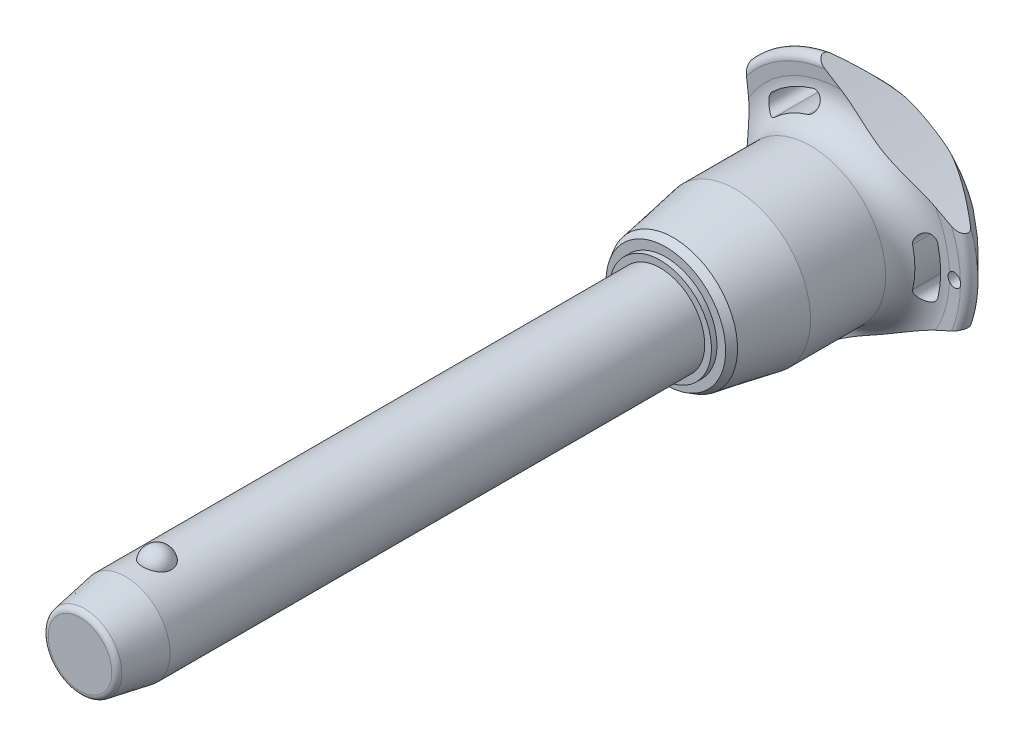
from build123d import *

# Parameters (mm, degrees)
SKETCH1_R           = 10
BOSS_EXTRUDE1_DEPTH = 110
SKETCH2_R           = 8.75
BOSS_EXTRUDE2_DEPTH = 50.7
BOSS_EXTRUDE3_START = 20.5
SKETCH1_2_R         = 10
BOSS_EXTRUDE3_DEPTH = 20.5
CHAMFER1_SIZE       = 10.25
CHAMFER1_SIZE2      = 1.807351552
FILLET1_R           = 1.25
SKETCH6_R           = 176.92625
CUT_EXTRUDE1_DEPTH  = 166.695054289
CIRPATTERN1_COUNT   = 3
SKETCH7_R           = 1.5
CUT_EXTRUDE2_DEPTH  = 166.603156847


with BuildPart() as part:
    # Sketch1 → Boss-Extrude1 (new body)
    with BuildSketch(Plane.XY):
        Circle(SKETCH1_R)
    extrude(amount=-BOSS_EXTRUDE1_DEPTH)

    # Sketch2 → Boss-Extrude2 (add)
    with BuildSketch(Plane(origin=(0, 0, -110), x_dir=(-1, 0, 0), z_dir=(0, 0, -1))):
        with Locations(Location((0, 0, 0), (0, 0, 180))):
            Circle(SKETCH2_R)
    extrude(amount=BOSS_EXTRUDE2_DEPTH)

    # Sketch3 → Revolve1 (revolve)
    with BuildSketch(Plane(origin=(0, 0, 0), x_dir=(0, 0, -1), z_dir=(1, 0, 0))):
        with BuildLine():
            Line((-3.201562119, 12.5), (-3.201562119, 5.9))
            ThreePointArc((-3.201562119, 5.9), (0.098437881, 9.2), (-3.201562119, 12.5))
        make_face()
        with BuildLine():
            Line((-3.201562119, -5.9), (-3.201562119, -12.5))
            ThreePointArc((-3.201562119, -12.5), (0.098437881, -9.2), (-3.201562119, -5.9))
        make_face()
    revolve(axis=Axis((0, -5.9, 3.201562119), (0, 1, 0)))

    # Sketch1_2 → Boss-Extrude3 (add)
    with BuildSketch(Plane.XY.offset(BOSS_EXTRUDE3_START)):
        Circle(SKETCH1_2_R)
    extrude(amount=-BOSS_EXTRUDE3_DEPTH)

    # Chamfer1
    chamfer1_edges = [part.edges().sort_by_distance(p)[0] for p in [
        (-10, 0, 20.5),
    ]]
    chamfer1_side = [part.faces().sort_by_distance(p)[0] for p in [
        (-10, 0, -44.75),
    ]]
    chamfer(chamfer1_edges, length=CHAMFER1_SIZE, length2=CHAMFER1_SIZE2, reference=chamfer1_side[0])

    # Fillet1
    fillet1_edges = [part.edges().sort_by_distance(p)[0] for p in [
        (-8.192648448, 0, 20.5),
        (-8.75, 0, -160.7),
    ]]
    fillet(fillet1_edges, radius=FILLET1_R)

    # Sketch4 → Revolve2 (revolve)
    with BuildSketch(Plane(origin=(0, 0, 0), x_dir=(0, 0, -1), z_dir=(1, 0, 0)), mode=Mode.PRIVATE) as revolve2_sk:
        Polygon((110, 0), (110, 11.504815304), (111.25, 11.504815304), (111.25, 13.461079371), (112.944174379, 14.439211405), (126.9, 16.9), (143.8, 16.9), (143.8, 0), align=None)
    revolve(revolve2_sk.sketch.rotate(Axis((0, 0, -143.8), (0, 0, 1)), 90), axis=Axis((0, 0, -143.8), (0, 0, 1)))

    # Sketch5 → Revolve3 (revolve)
    with BuildSketch(Plane(origin=(0, 0, 0), x_dir=(0, 0, -1), z_dir=(1, 0, 0)), mode=Mode.PRIVATE) as revolve3_sk:
        with BuildLine():
            Line((150.790129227, 24.271609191), (150.652256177, 26.865060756))
            ThreePointArc((150.652256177, 26.865060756), (151.598671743, 28.411427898), (153.38137085, 28.08137085))
            Line((153.38137085, 28.08137085), (159.763226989, 21.69951471))
            ThreePointArc((159.763226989, 21.69951471), (160.7, 19.381044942), (159.683055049, 17.096604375))
            ThreePointArc((159.683055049, 17.096604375), (154.18864484, 9.321268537), (152.25, 0))
            Line((152.25, 0), (143.8, 0))
            Line((143.8, 0), (143.8, 16.9))
            ThreePointArc((143.8, 16.9), (148.879432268, 19.083427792), (150.790129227, 24.271609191))
        make_face()
    revolve(revolve3_sk.sketch.rotate(Axis((0, 0, -152.25), (0, 0, 1)), 90), axis=Axis((0, 0, -152.25), (0, 0, 1)))

    # Sketch6 → Cut-Extrude1 (cut, through all)
    with BuildSketch(Plane.XY):
        with Locations((-197.42625, 0)):
            Circle(SKETCH6_R)
        with BuildLine():
            ThreePointArc((21.802992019, -5.260839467), (22.428706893, 0), (21.802992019, 5.260839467))
            ThreePointArc((21.802992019, 5.260839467), (19.579234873, 6.620060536), (18.220013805, 4.39630339))
            ThreePointArc((18.220013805, 4.39630339), (18.742902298, 0), (18.220013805, -4.39630339))
            ThreePointArc((18.220013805, -4.39630339), (19.579234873, -6.620060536), (21.802992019, -5.260839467))
        make_face()
    cut_extrude1 = extrude(amount=-CUT_EXTRUDE1_DEPTH, mode=Mode.SUBTRACT)

    # CirPattern1: Cut-Extrude1 ×3 about axis
    cirpattern1_axis = Axis((0, 0, 0), (0, 0, 1))
    for i in range(1, CIRPATTERN1_COUNT):
        add(cut_extrude1.rotate(cirpattern1_axis, i * 360 / CIRPATTERN1_COUNT), mode=Mode.SUBTRACT)

    # Sketch7 → Cut-Extrude2 (cut, through all)
    with BuildSketch(Plane.XY):
        with Locations(Location((25.428706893, 0, 0), (0, 0, 17.230769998))):
            Circle(SKETCH7_R)
    extrude(amount=-CUT_EXTRUDE2_DEPTH, mode=Mode.SUBTRACT)


solid = part.part
